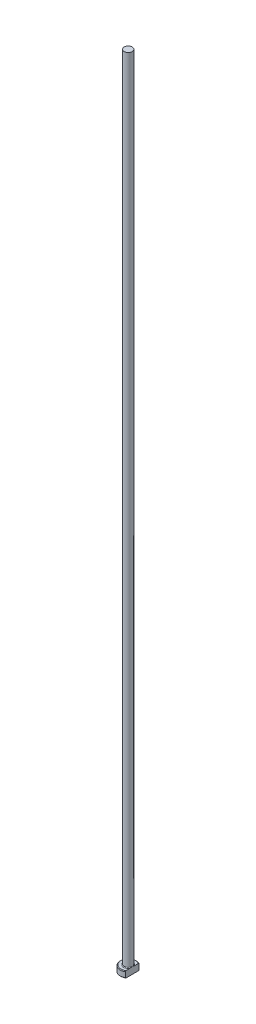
from build123d import *
from build123d.topology import SkipClean

# Parameters (mm, degrees)
CHAMFER1_SIZE = 0.2
FILLET1_R     = 0.2
KEY_DEPTH     = 251.02499875


with BuildPart() as part:
    # Sketch1 → Revolve1 (revolve)
    with BuildSketch(Plane.XY, mode=Mode.PRIVATE) as revolve1_sk:
        Polygon((0, 0), (-2.5, 0), (-2.5, 2), (-1.25, 2), (-1.25, 250), (0, 250), align=None)
    revolve(revolve1_sk.sketch.rotate(Axis((0, 259.958771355, 0), (0, -1, 0)), 270), axis=Axis((0, 259.958771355, 0), (0, -1, 0)))

    # Chamfer1
    chamfer1_edges = [part.edges().sort_by_distance(p)[0] for p in [
        (0, 2, -2.5),
        (0, 0, -2.5),
    ]]
    chamfer(chamfer1_edges, length=CHAMFER1_SIZE)

    # Fillet1
    fillet1_edges = [part.edges().sort_by_distance(p)[0] for p in [
        (0, 2, -1.25),
    ]]
    fillet(fillet1_edges, radius=FILLET1_R)

    # Sketch2 → KEY (cut, through all)
    with SkipClean():  # the faces are left unmerged after this step: merging them gives an invalid solid
        with BuildSketch(Plane(origin=(0, 0, 0), x_dir=(1, 0, 0), z_dir=(0, 1, 0))):
            with BuildLine():
                Line((1.25, 2.165063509), (1.25, -2.165063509))
                ThreePointArc((1.25, -2.165063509), (2.5, 0), (1.25, 2.165063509))
            make_face()
        extrude(amount=KEY_DEPTH, mode=Mode.SUBTRACT)


solid = part.part
